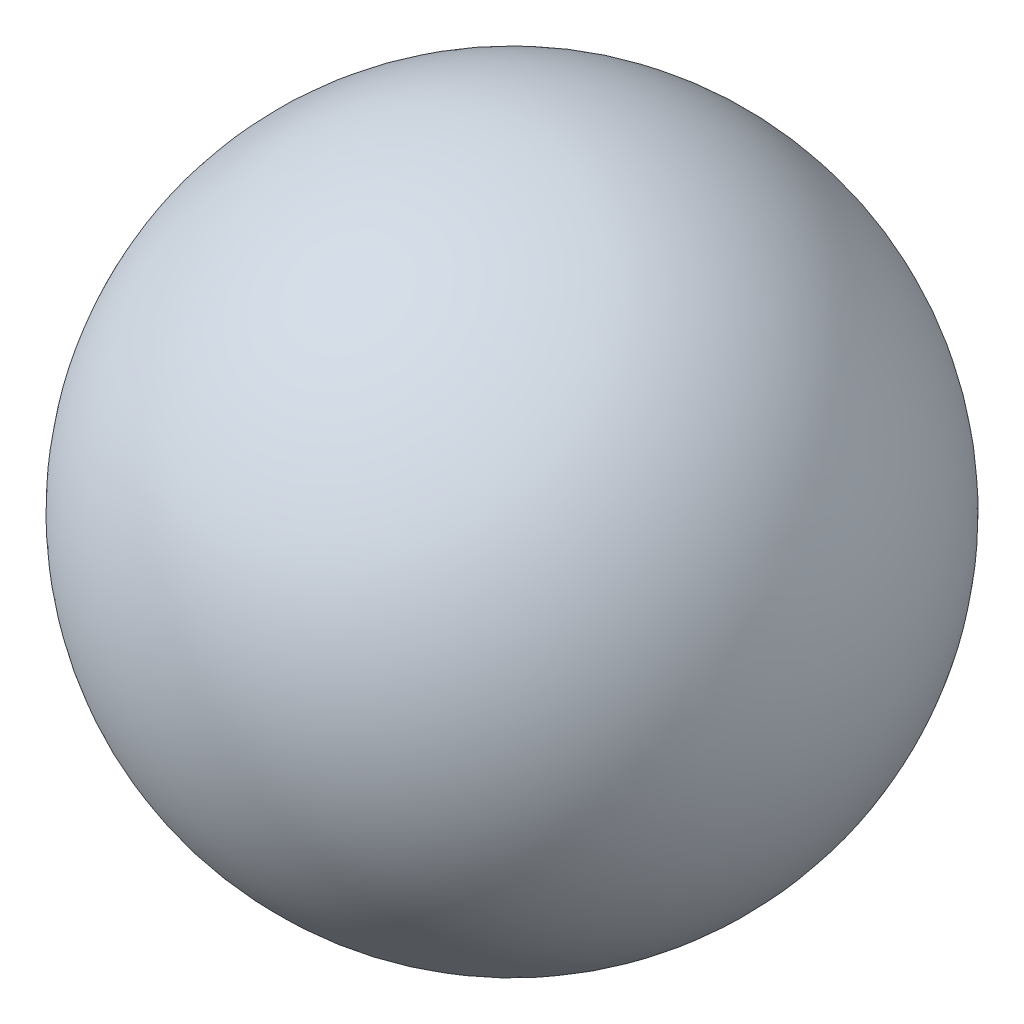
from build123d import *


with BuildPart() as part:
    # Esquisse1 → Base-R_volution (revolve)
    with BuildSketch(Plane(origin=(0, 0, 0), x_dir=(1, 0, 0), z_dir=(0, 1, 0))):
        with BuildLine():
            Line((1.9, 4.4), (7.9, 4.4))
            ThreePointArc((7.9, 4.4), (4.9, 7.4), (1.9, 4.4))
        make_face()
    revolve(axis=Axis((-0.6, 0, -4.4), (1, 0, 0)))


solid = part.part
